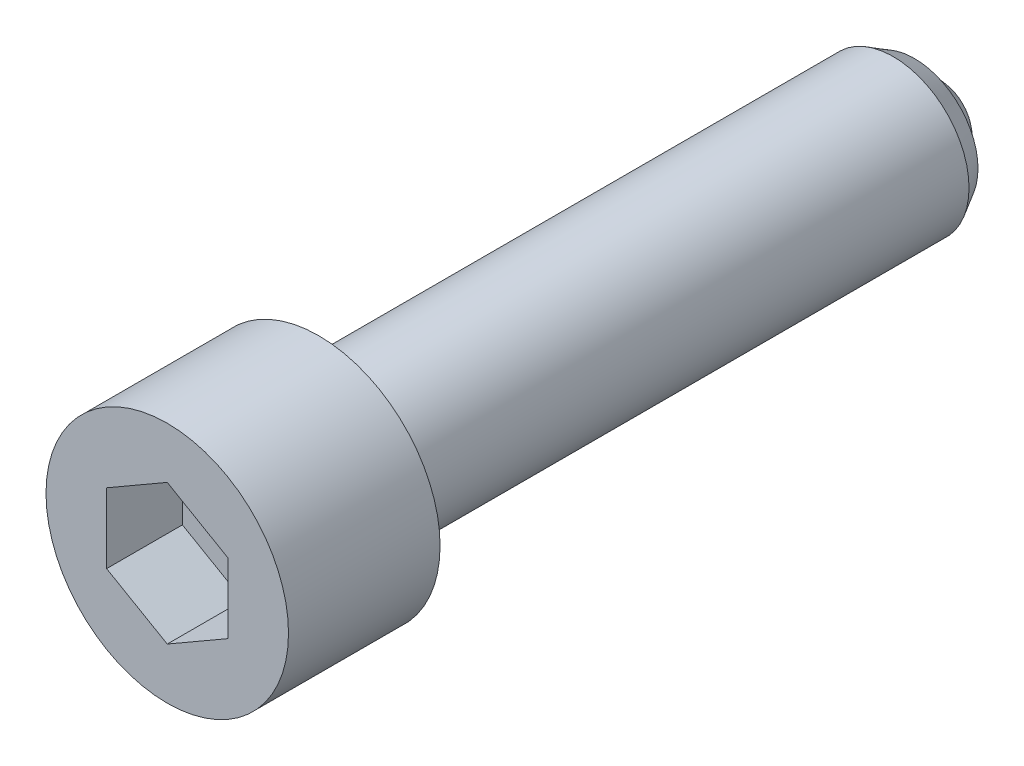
ISO-10303-21;
HEADER;
FILE_DESCRIPTION(('STEP AP214'),'2;1');
FILE_NAME('part.step','',(''),(''),'','','');
FILE_SCHEMA(('AUTOMOTIVE_DESIGN { 1 0 10303 214 1 1 1 1 }'));
ENDSEC;
DATA;
#1=APPLICATION_CONTEXT('core data for automotive mechanical design processes');
#2=APPLICATION_PROTOCOL_DEFINITION('international standard','automotive_design',2000,#1);
#3=PRODUCT_CONTEXT('',#1,'mechanical');
#4=PRODUCT('Part','Part','',(#3));
#5=PRODUCT_RELATED_PRODUCT_CATEGORY('part','',(#4));
#6=PRODUCT_DEFINITION_FORMATION('','',#4);
#7=PRODUCT_DEFINITION_CONTEXT('part definition',#1,'design');
#8=PRODUCT_DEFINITION('design','',#6,#7);
#9=PRODUCT_DEFINITION_SHAPE('','',#8);
#10=(LENGTH_UNIT() NAMED_UNIT(*) SI_UNIT(.MILLI.,.METRE.));
#11=(NAMED_UNIT(*) PLANE_ANGLE_UNIT() SI_UNIT($,.RADIAN.));
#12=(NAMED_UNIT(*) SI_UNIT($,.STERADIAN.) SOLID_ANGLE_UNIT());
#13=UNCERTAINTY_MEASURE_WITH_UNIT(LENGTH_MEASURE(1.E-05),#10,'distance_accuracy_value','');
#14=(GEOMETRIC_REPRESENTATION_CONTEXT(3) GLOBAL_UNCERTAINTY_ASSIGNED_CONTEXT((#13)) GLOBAL_UNIT_ASSIGNED_CONTEXT((#10,
#11,#12)) REPRESENTATION_CONTEXT('',''));
#15=CARTESIAN_POINT('',(0.,0.,0.));
#16=DIRECTION('',(0.,0.,1.));
#17=DIRECTION('',(1.,0.,0.));
#18=AXIS2_PLACEMENT_3D('',#15,#16,#17);
#19=CARTESIAN_POINT('',(0.,0.,3.5));
#20=DIRECTION('',(0.,0.,-1.));
#21=DIRECTION('',(1.,0.,0.));
#22=AXIS2_PLACEMENT_3D('',#19,#20,#21);
#23=SPHERICAL_SURFACE('',#22,3.5);
#24=CARTESIAN_POINT('',(0.,0.,2.4));
#25=DIRECTION('',(0.,0.,-1.));
#26=DIRECTION('',(1.,0.,0.));
#27=AXIS2_PLACEMENT_3D('',#24,#25,#26);
#28=CIRCLE('',#27,3.32264954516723);
#29=CARTESIAN_POINT('',(3.32264954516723,0.,2.4));
#30=VERTEX_POINT('',#29);
#31=EDGE_CURVE('E9',#30,#30,#28,.T.);
#32=ORIENTED_EDGE('',*,*,#31,.T.);
#33=EDGE_LOOP('',(#32));
#34=FACE_BOUND('',#33,.T.);
#35=ADVANCED_FACE('F15',(#34),#23,.T.);
#36=CARTESIAN_POINT('',(4.19170962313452,0.,2.4));
#37=DIRECTION('',(0.,0.,1.));
#38=DIRECTION('',(-1.,0.,0.));
#39=AXIS2_PLACEMENT_3D('',#36,#37,#38);
#40=PLANE('',#39);
#41=ORIENTED_EDGE('',*,*,#31,.F.);
#42=EDGE_LOOP('',(#41));
#43=FACE_BOUND('',#42,.T.);
#44=CARTESIAN_POINT('',(0.,0.,2.4));
#45=DIRECTION('',(0.,0.,-1.));
#46=DIRECTION('',(1.,0.,0.));
#47=AXIS2_PLACEMENT_3D('',#44,#45,#46);
#48=CIRCLE('',#47,4.19170962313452);
#49=CARTESIAN_POINT('',(4.19170962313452,0.,2.4));
#50=VERTEX_POINT('',#49);
#51=EDGE_CURVE('E22',#50,#50,#48,.T.);
#52=ORIENTED_EDGE('',*,*,#51,.T.);
#53=EDGE_LOOP('',(#52));
#54=FACE_BOUND('',#53,.T.);
#55=ADVANCED_FACE('F136',(#43,#54),#40,.F.);
#56=CARTESIAN_POINT('',(0.,0.,3.8));
#57=DIRECTION('',(0.,0.,1.));
#58=DIRECTION('',(-1.,0.,0.));
#59=AXIS2_PLACEMENT_3D('',#56,#57,#58);
#60=CONICAL_SURFACE('',#59,5.,0.523598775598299);
#61=ORIENTED_EDGE('',*,*,#51,.F.);
#62=EDGE_LOOP('',(#61));
#63=FACE_BOUND('',#62,.T.);
#64=CARTESIAN_POINT('',(0.,0.,3.8));
#65=DIRECTION('',(0.,0.,-1.));
#66=DIRECTION('',(1.,0.,0.));
#67=AXIS2_PLACEMENT_3D('',#64,#65,#66);
#68=CIRCLE('',#67,5.);
#69=CARTESIAN_POINT('',(5.,0.,3.8));
#70=VERTEX_POINT('',#69);
#71=EDGE_CURVE('E131',#70,#70,#68,.T.);
#72=ORIENTED_EDGE('',*,*,#71,.T.);
#73=EDGE_LOOP('',(#72));
#74=FACE_BOUND('',#73,.T.);
#75=ADVANCED_FACE('F138',(#63,#74),#60,.T.);
#76=CARTESIAN_POINT('',(0.,0.,-8.3));
#77=DIRECTION('',(0.,0.,-1.));
#78=DIRECTION('',(1.,0.,0.));
#79=AXIS2_PLACEMENT_3D('',#76,#77,#78);
#80=CYLINDRICAL_SURFACE('',#79,5.);
#81=CARTESIAN_POINT('',(0.,0.,41.7));
#82=DIRECTION('',(0.,0.,-1.));
#83=DIRECTION('',(1.,0.,0.));
#84=AXIS2_PLACEMENT_3D('',#81,#82,#83);
#85=CIRCLE('',#84,5.);
#86=CARTESIAN_POINT('',(5.,0.,41.7));
#87=VERTEX_POINT('',#86);
#88=EDGE_CURVE('E128',#87,#87,#85,.T.);
#89=ORIENTED_EDGE('',*,*,#88,.T.);
#90=EDGE_LOOP('',(#89));
#91=FACE_BOUND('',#90,.T.);
#92=ORIENTED_EDGE('',*,*,#71,.F.);
#93=EDGE_LOOP('',(#92));
#94=FACE_BOUND('',#93,.T.);
#95=ADVANCED_FACE('F141',(#91,#94),#80,.T.);
#96=CARTESIAN_POINT('',(5.,0.,41.7));
#97=DIRECTION('',(0.,0.,-1.));
#98=DIRECTION('',(1.,0.,0.));
#99=AXIS2_PLACEMENT_3D('',#96,#97,#98);
#100=PLANE('',#99);
#101=CARTESIAN_POINT('',(0.,0.,41.7));
#102=DIRECTION('',(0.,0.,-1.));
#103=DIRECTION('',(1.,0.,0.));
#104=AXIS2_PLACEMENT_3D('',#101,#102,#103);
#105=CIRCLE('',#104,8.);
#106=CARTESIAN_POINT('',(8.,0.,41.7));
#107=VERTEX_POINT('',#106);
#108=EDGE_CURVE('E125',#107,#107,#105,.T.);
#109=ORIENTED_EDGE('',*,*,#108,.T.);
#110=EDGE_LOOP('',(#109));
#111=FACE_BOUND('',#110,.T.);
#112=ORIENTED_EDGE('',*,*,#88,.F.);
#113=EDGE_LOOP('',(#112));
#114=FACE_BOUND('',#113,.T.);
#115=ADVANCED_FACE('F146',(#111,#114),#100,.T.);
#116=CARTESIAN_POINT('',(0.,0.,-8.3));
#117=DIRECTION('',(0.,0.,-1.));
#118=DIRECTION('',(1.,0.,0.));
#119=AXIS2_PLACEMENT_3D('',#116,#117,#118);
#120=CYLINDRICAL_SURFACE('',#119,8.);
#121=CARTESIAN_POINT('',(0.,0.,51.7));
#122=DIRECTION('',(0.,0.,-1.));
#123=DIRECTION('',(1.,0.,0.));
#124=AXIS2_PLACEMENT_3D('',#121,#122,#123);
#125=CIRCLE('',#124,8.);
#126=CARTESIAN_POINT('',(8.,0.,51.7));
#127=VERTEX_POINT('',#126);
#128=EDGE_CURVE('E122',#127,#127,#125,.T.);
#129=ORIENTED_EDGE('',*,*,#128,.T.);
#130=EDGE_LOOP('',(#129));
#131=FACE_BOUND('',#130,.T.);
#132=ORIENTED_EDGE('',*,*,#108,.F.);
#133=EDGE_LOOP('',(#132));
#134=FACE_BOUND('',#133,.T.);
#135=ADVANCED_FACE('F153',(#131,#134),#120,.T.);
#136=CARTESIAN_POINT('',(8.,0.,51.7));
#137=DIRECTION('',(0.,0.,1.));
#138=DIRECTION('',(-1.,0.,0.));
#139=AXIS2_PLACEMENT_3D('',#136,#137,#138);
#140=PLANE('',#139);
#141=DIRECTION('',(-0.86602540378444,0.5,0.));
#142=VECTOR('',#141,1.);
#143=CARTESIAN_POINT('',(4.,2.30940107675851,51.7));
#144=LINE('',#143,#142);
#145=CARTESIAN_POINT('',(4.,2.30940107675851,51.7));
#146=VERTEX_POINT('',#145);
#147=CARTESIAN_POINT('',(0.,4.618802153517,51.7));
#148=VERTEX_POINT('',#147);
#149=EDGE_CURVE('E29',#146,#148,#144,.T.);
#150=ORIENTED_EDGE('',*,*,#149,.F.);
#151=DIRECTION('',(0.,1.,0.));
#152=VECTOR('',#151,1.);
#153=CARTESIAN_POINT('',(4.,-2.30940107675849,51.7));
#154=LINE('',#153,#152);
#155=CARTESIAN_POINT('',(4.,-2.30940107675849,51.7));
#156=VERTEX_POINT('',#155);
#157=EDGE_CURVE('E98',#156,#146,#154,.T.);
#158=ORIENTED_EDGE('',*,*,#157,.F.);
#159=DIRECTION('',(-0.866025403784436,-0.5,0.));
#160=VECTOR('',#159,1.);
#161=CARTESIAN_POINT('',(4.,-2.30940107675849,51.7));
#162=LINE('',#161,#160);
#163=CARTESIAN_POINT('',(0.,-4.61880215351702,51.7));
#164=VERTEX_POINT('',#163);
#165=EDGE_CURVE('E93',#156,#164,#162,.T.);
#166=ORIENTED_EDGE('',*,*,#165,.T.);
#167=DIRECTION('',(0.866025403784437,-0.5,0.));
#168=VECTOR('',#167,1.);
#169=CARTESIAN_POINT('',(-4.,-2.30940107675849,51.7));
#170=LINE('',#169,#168);
#171=CARTESIAN_POINT('',(-4.,-2.30940107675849,51.7));
#172=VERTEX_POINT('',#171);
#173=EDGE_CURVE('E91',#172,#164,#170,.T.);
#174=ORIENTED_EDGE('',*,*,#173,.F.);
#175=DIRECTION('',(0.,1.,0.));
#176=VECTOR('',#175,1.);
#177=CARTESIAN_POINT('',(-4.,-2.30940107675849,51.7));
#178=LINE('',#177,#176);
#179=CARTESIAN_POINT('',(-4.,2.30940107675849,51.7));
#180=VERTEX_POINT('',#179);
#181=EDGE_CURVE('E72',#172,#180,#178,.T.);
#182=ORIENTED_EDGE('',*,*,#181,.T.);
#183=DIRECTION('',(0.866025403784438,0.5,0.));
#184=VECTOR('',#183,1.);
#185=CARTESIAN_POINT('',(-4.,2.30940107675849,51.7));
#186=LINE('',#185,#184);
#187=EDGE_CURVE('E83',#180,#148,#186,.T.);
#188=ORIENTED_EDGE('',*,*,#187,.T.);
#189=EDGE_LOOP('',(#150,#158,#166,#174,#182,#188));
#190=FACE_BOUND('',#189,.T.);
#191=ORIENTED_EDGE('',*,*,#128,.F.);
#192=EDGE_LOOP('',(#191));
#193=FACE_BOUND('',#192,.T.);
#194=ADVANCED_FACE('F87',(#190,#193),#140,.T.);
#195=CARTESIAN_POINT('',(4.,2.30940107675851,46.7));
#196=DIRECTION('',(0.5,0.86602540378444,0.));
#197=DIRECTION('',(0.86602540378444,-0.5,0.));
#198=AXIS2_PLACEMENT_3D('',#195,#196,#197);
#199=PLANE('',#198);
#200=DIRECTION('',(0.,0.,1.));
#201=VECTOR('',#200,1.);
#202=CARTESIAN_POINT('',(4.,2.30940107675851,46.7));
#203=LINE('',#202,#201);
#204=CARTESIAN_POINT('',(4.,2.30940107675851,46.7));
#205=VERTEX_POINT('',#204);
#206=EDGE_CURVE('E36',#205,#146,#203,.T.);
#207=ORIENTED_EDGE('',*,*,#206,.T.);
#208=ORIENTED_EDGE('',*,*,#149,.T.);
#209=DIRECTION('',(0.,0.,1.));
#210=VECTOR('',#209,1.);
#211=CARTESIAN_POINT('',(0.,4.618802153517,46.7));
#212=LINE('',#211,#210);
#213=CARTESIAN_POINT('',(0.,4.618802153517,46.7));
#214=VERTEX_POINT('',#213);
#215=EDGE_CURVE('E80',#214,#148,#212,.T.);
#216=ORIENTED_EDGE('',*,*,#215,.F.);
#217=DIRECTION('',(-0.86602540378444,0.5,0.));
#218=VECTOR('',#217,1.);
#219=CARTESIAN_POINT('',(4.,2.30940107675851,46.7));
#220=LINE('',#219,#218);
#221=EDGE_CURVE('E100',#205,#214,#220,.T.);
#222=ORIENTED_EDGE('',*,*,#221,.F.);
#223=EDGE_LOOP('',(#207,#208,#216,#222));
#224=FACE_BOUND('',#223,.T.);
#225=ADVANCED_FACE('F205',(#224),#199,.F.);
#226=CARTESIAN_POINT('',(4.,-2.30940107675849,46.7));
#227=DIRECTION('',(1.,0.,0.));
#228=DIRECTION('',(0.,0.,1.));
#229=AXIS2_PLACEMENT_3D('',#226,#227,#228);
#230=PLANE('',#229);
#231=DIRECTION('',(0.,0.,1.));
#232=VECTOR('',#231,1.);
#233=CARTESIAN_POINT('',(4.,-2.30940107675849,46.7));
#234=LINE('',#233,#232);
#235=CARTESIAN_POINT('',(4.,-2.30940107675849,46.7));
#236=VERTEX_POINT('',#235);
#237=EDGE_CURVE('E119',#236,#156,#234,.T.);
#238=ORIENTED_EDGE('',*,*,#237,.T.);
#239=ORIENTED_EDGE('',*,*,#157,.T.);
#240=ORIENTED_EDGE('',*,*,#206,.F.);
#241=DIRECTION('',(0.,1.,0.));
#242=VECTOR('',#241,1.);
#243=CARTESIAN_POINT('',(4.,-2.30940107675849,46.7));
#244=LINE('',#243,#242);
#245=EDGE_CURVE('E112',#236,#205,#244,.T.);
#246=ORIENTED_EDGE('',*,*,#245,.F.);
#247=EDGE_LOOP('',(#238,#239,#240,#246));
#248=FACE_BOUND('',#247,.T.);
#249=ADVANCED_FACE('F214',(#248),#230,.F.);
#250=CARTESIAN_POINT('',(4.,-2.30940107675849,46.7));
#251=DIRECTION('',(-0.5,0.866025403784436,0.));
#252=DIRECTION('',(0.866025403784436,0.5,0.));
#253=AXIS2_PLACEMENT_3D('',#250,#251,#252);
#254=PLANE('',#253);
#255=DIRECTION('',(0.,0.,1.));
#256=VECTOR('',#255,1.);
#257=CARTESIAN_POINT('',(0.,-4.61880215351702,46.7));
#258=LINE('',#257,#256);
#259=CARTESIAN_POINT('',(0.,-4.61880215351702,46.7));
#260=VERTEX_POINT('',#259);
#261=EDGE_CURVE('E117',#260,#164,#258,.T.);
#262=ORIENTED_EDGE('',*,*,#261,.T.);
#263=ORIENTED_EDGE('',*,*,#165,.F.);
#264=ORIENTED_EDGE('',*,*,#237,.F.);
#265=DIRECTION('',(-0.866025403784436,-0.5,0.));
#266=VECTOR('',#265,1.);
#267=CARTESIAN_POINT('',(4.,-2.30940107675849,46.7));
#268=LINE('',#267,#266);
#269=EDGE_CURVE('E109',#236,#260,#268,.T.);
#270=ORIENTED_EDGE('',*,*,#269,.T.);
#271=EDGE_LOOP('',(#262,#263,#264,#270));
#272=FACE_BOUND('',#271,.T.);
#273=ADVANCED_FACE('F223',(#272),#254,.T.);
#274=CARTESIAN_POINT('',(-4.,-2.30940107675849,46.7));
#275=DIRECTION('',(-0.5,-0.866025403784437,0.));
#276=DIRECTION('',(-0.866025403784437,0.5,0.));
#277=AXIS2_PLACEMENT_3D('',#274,#275,#276);
#278=PLANE('',#277);
#279=DIRECTION('',(0.,0.,1.));
#280=VECTOR('',#279,1.);
#281=CARTESIAN_POINT('',(-4.,-2.30940107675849,46.7));
#282=LINE('',#281,#280);
#283=CARTESIAN_POINT('',(-4.,-2.30940107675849,46.7));
#284=VERTEX_POINT('',#283);
#285=EDGE_CURVE('E79',#284,#172,#282,.T.);
#286=ORIENTED_EDGE('',*,*,#285,.T.);
#287=ORIENTED_EDGE('',*,*,#173,.T.);
#288=ORIENTED_EDGE('',*,*,#261,.F.);
#289=DIRECTION('',(0.866025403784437,-0.5,0.));
#290=VECTOR('',#289,1.);
#291=CARTESIAN_POINT('',(-4.,-2.30940107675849,46.7));
#292=LINE('',#291,#290);
#293=EDGE_CURVE('E106',#284,#260,#292,.T.);
#294=ORIENTED_EDGE('',*,*,#293,.F.);
#295=EDGE_LOOP('',(#286,#287,#288,#294));
#296=FACE_BOUND('',#295,.T.);
#297=ADVANCED_FACE('F232',(#296),#278,.F.);
#298=CARTESIAN_POINT('',(-4.,-2.30940107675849,46.7));
#299=DIRECTION('',(1.,0.,0.));
#300=DIRECTION('',(0.,0.,1.));
#301=AXIS2_PLACEMENT_3D('',#298,#299,#300);
#302=PLANE('',#301);
#303=DIRECTION('',(0.,0.,1.));
#304=VECTOR('',#303,1.);
#305=CARTESIAN_POINT('',(-4.,2.30940107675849,46.7));
#306=LINE('',#305,#304);
#307=CARTESIAN_POINT('',(-4.,2.30940107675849,46.7));
#308=VERTEX_POINT('',#307);
#309=EDGE_CURVE('E68',#308,#180,#306,.T.);
#310=ORIENTED_EDGE('',*,*,#309,.T.);
#311=ORIENTED_EDGE('',*,*,#181,.F.);
#312=ORIENTED_EDGE('',*,*,#285,.F.);
#313=DIRECTION('',(0.,1.,0.));
#314=VECTOR('',#313,1.);
#315=CARTESIAN_POINT('',(-4.,-2.30940107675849,46.7));
#316=LINE('',#315,#314);
#317=EDGE_CURVE('E75',#284,#308,#316,.T.);
#318=ORIENTED_EDGE('',*,*,#317,.T.);
#319=EDGE_LOOP('',(#310,#311,#312,#318));
#320=FACE_BOUND('',#319,.T.);
#321=ADVANCED_FACE('F70',(#320),#302,.T.);
#322=CARTESIAN_POINT('',(-4.,2.30940107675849,46.7));
#323=DIRECTION('',(0.5,-0.866025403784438,0.));
#324=DIRECTION('',(-0.866025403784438,-0.5,0.));
#325=AXIS2_PLACEMENT_3D('',#322,#323,#324);
#326=PLANE('',#325);
#327=DIRECTION('',(0.866025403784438,0.5,0.));
#328=VECTOR('',#327,1.);
#329=CARTESIAN_POINT('',(-4.,2.30940107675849,46.7));
#330=LINE('',#329,#328);
#331=EDGE_CURVE('E103',#308,#214,#330,.T.);
#332=ORIENTED_EDGE('',*,*,#331,.T.);
#333=ORIENTED_EDGE('',*,*,#215,.T.);
#334=ORIENTED_EDGE('',*,*,#187,.F.);
#335=ORIENTED_EDGE('',*,*,#309,.F.);
#336=EDGE_LOOP('',(#332,#333,#334,#335));
#337=FACE_BOUND('',#336,.T.);
#338=ADVANCED_FACE('F84',(#337),#326,.T.);
#339=CARTESIAN_POINT('',(8.,0.,46.7));
#340=DIRECTION('',(0.,0.,1.));
#341=DIRECTION('',(-1.,0.,0.));
#342=AXIS2_PLACEMENT_3D('',#339,#340,#341);
#343=PLANE('',#342);
#344=ORIENTED_EDGE('',*,*,#221,.T.);
#345=ORIENTED_EDGE('',*,*,#331,.F.);
#346=ORIENTED_EDGE('',*,*,#317,.F.);
#347=ORIENTED_EDGE('',*,*,#293,.T.);
#348=ORIENTED_EDGE('',*,*,#269,.F.);
#349=ORIENTED_EDGE('',*,*,#245,.T.);
#350=EDGE_LOOP('',(#344,#345,#346,#347,#348,#349));
#351=FACE_BOUND('',#350,.T.);
#352=ADVANCED_FACE('F252',(#351),#343,.T.);
#353=CLOSED_SHELL('',(#35,#55,#75,#95,#115,#135,#194,#225,#249,#273,#297,#321,#338,#352));
#354=MANIFOLD_SOLID_BREP('B1',#353);
#355=ADVANCED_BREP_SHAPE_REPRESENTATION('',(#18,#354),#14);
#356=SHAPE_DEFINITION_REPRESENTATION(#9,#355);
ENDSEC;
END-ISO-10303-21;
